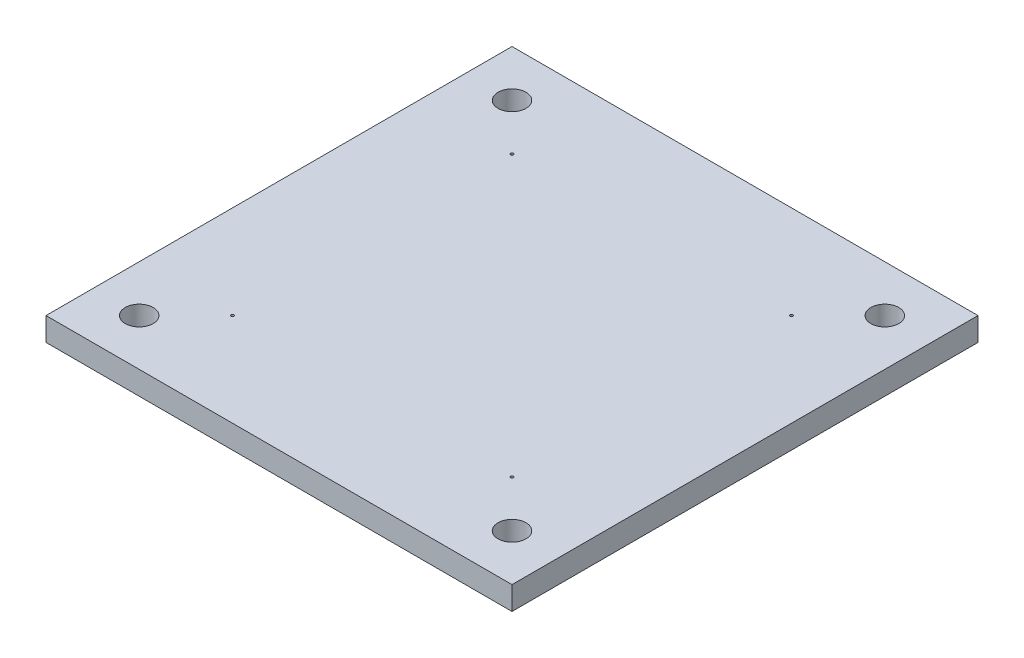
ISO-10303-21;
HEADER;
FILE_DESCRIPTION(('STEP AP214'),'2;1');
FILE_NAME('part.step','',(''),(''),'','','');
FILE_SCHEMA(('AUTOMOTIVE_DESIGN { 1 0 10303 214 1 1 1 1 }'));
ENDSEC;
DATA;
#1=APPLICATION_CONTEXT('core data for automotive mechanical design processes');
#2=APPLICATION_PROTOCOL_DEFINITION('international standard','automotive_design',2000,#1);
#3=PRODUCT_CONTEXT('',#1,'mechanical');
#4=PRODUCT('Part','Part','',(#3));
#5=PRODUCT_RELATED_PRODUCT_CATEGORY('part','',(#4));
#6=PRODUCT_DEFINITION_FORMATION('','',#4);
#7=PRODUCT_DEFINITION_CONTEXT('part definition',#1,'design');
#8=PRODUCT_DEFINITION('design','',#6,#7);
#9=PRODUCT_DEFINITION_SHAPE('','',#8);
#10=(LENGTH_UNIT() NAMED_UNIT(*) SI_UNIT(.MILLI.,.METRE.));
#11=(NAMED_UNIT(*) PLANE_ANGLE_UNIT() SI_UNIT($,.RADIAN.));
#12=(NAMED_UNIT(*) SI_UNIT($,.STERADIAN.) SOLID_ANGLE_UNIT());
#13=UNCERTAINTY_MEASURE_WITH_UNIT(LENGTH_MEASURE(1.E-05),#10,'distance_accuracy_value','');
#14=(GEOMETRIC_REPRESENTATION_CONTEXT(3) GLOBAL_UNCERTAINTY_ASSIGNED_CONTEXT((#13)) GLOBAL_UNIT_ASSIGNED_CONTEXT((#10,
#11,#12)) REPRESENTATION_CONTEXT('',''));
#15=CARTESIAN_POINT('',(0.,0.,0.));
#16=DIRECTION('',(0.,0.,1.));
#17=DIRECTION('',(1.,0.,0.));
#18=AXIS2_PLACEMENT_3D('',#15,#16,#17);
#19=CARTESIAN_POINT('',(-250.,25.,250.));
#20=DIRECTION('',(0.,-1.,0.));
#21=DIRECTION('',(0.,0.,-1.));
#22=AXIS2_PLACEMENT_3D('',#19,#20,#21);
#23=PLANE('',#22);
#24=CARTESIAN_POINT('',(200.,25.,-200.));
#25=DIRECTION('',(0.,-1.,0.));
#26=DIRECTION('',(0.,0.,1.));
#27=AXIS2_PLACEMENT_3D('',#24,#25,#26);
#28=CIRCLE('',#27,15.);
#29=CARTESIAN_POINT('',(200.,25.,-185.));
#30=VERTEX_POINT('',#29);
#31=EDGE_CURVE('E452',#30,#30,#28,.T.);
#32=ORIENTED_EDGE('',*,*,#31,.T.);
#33=EDGE_LOOP('',(#32));
#34=FACE_BOUND('',#33,.T.);
#35=CARTESIAN_POINT('',(150.,25.,150.));
#36=DIRECTION('',(0.,-1.,0.));
#37=DIRECTION('',(-0.70710678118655,0.,-0.707106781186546));
#38=AXIS2_PLACEMENT_3D('',#35,#36,#37);
#39=ELLIPSE('',#38,1.50763363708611,1.50000000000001);
#40=CARTESIAN_POINT('',(148.933942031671,25.,148.933942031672));
#41=VERTEX_POINT('',#40);
#42=EDGE_CURVE('E437',#41,#41,#39,.T.);
#43=ORIENTED_EDGE('',*,*,#42,.T.);
#44=EDGE_LOOP('',(#43));
#45=FACE_BOUND('',#44,.T.);
#46=CARTESIAN_POINT('',(200.,25.,200.));
#47=DIRECTION('',(0.,1.,0.));
#48=DIRECTION('',(0.,0.,-1.));
#49=AXIS2_PLACEMENT_3D('',#46,#47,#48);
#50=CIRCLE('',#49,15.);
#51=CARTESIAN_POINT('',(200.,25.,185.));
#52=VERTEX_POINT('',#51);
#53=EDGE_CURVE('E439',#52,#52,#50,.T.);
#54=ORIENTED_EDGE('',*,*,#53,.F.);
#55=EDGE_LOOP('',(#54));
#56=FACE_BOUND('',#55,.T.);
#57=CARTESIAN_POINT('',(-200.,25.,200.));
#58=DIRECTION('',(0.,-1.,0.));
#59=DIRECTION('',(0.,0.,-1.));
#60=AXIS2_PLACEMENT_3D('',#57,#58,#59);
#61=CIRCLE('',#60,15.);
#62=CARTESIAN_POINT('',(-200.,25.,185.));
#63=VERTEX_POINT('',#62);
#64=EDGE_CURVE('E435',#63,#63,#61,.T.);
#65=ORIENTED_EDGE('',*,*,#64,.T.);
#66=EDGE_LOOP('',(#65));
#67=FACE_BOUND('',#66,.T.);
#68=CARTESIAN_POINT('',(-150.,25.,-150.));
#69=DIRECTION('',(0.,-1.,0.));
#70=DIRECTION('',(0.70710678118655,0.,0.707106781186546));
#71=AXIS2_PLACEMENT_3D('',#68,#69,#70);
#72=ELLIPSE('',#71,1.50763363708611,1.50000000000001);
#73=CARTESIAN_POINT('',(-148.933942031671,25.,-148.933942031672));
#74=VERTEX_POINT('',#73);
#75=EDGE_CURVE('E429',#74,#74,#72,.T.);
#76=ORIENTED_EDGE('',*,*,#75,.T.);
#77=EDGE_LOOP('',(#76));
#78=FACE_BOUND('',#77,.T.);
#79=CARTESIAN_POINT('',(-200.,25.,-200.));
#80=DIRECTION('',(0.,1.,0.));
#81=DIRECTION('',(0.,0.,1.));
#82=AXIS2_PLACEMENT_3D('',#79,#80,#81);
#83=CIRCLE('',#82,15.);
#84=CARTESIAN_POINT('',(-200.,25.,-185.));
#85=VERTEX_POINT('',#84);
#86=EDGE_CURVE('E412',#85,#85,#83,.T.);
#87=ORIENTED_EDGE('',*,*,#86,.F.);
#88=EDGE_LOOP('',(#87));
#89=FACE_BOUND('',#88,.T.);
#90=DIRECTION('',(0.,0.,1.));
#91=VECTOR('',#90,1.);
#92=CARTESIAN_POINT('',(-250.,25.,250.));
#93=LINE('',#92,#91);
#94=CARTESIAN_POINT('',(-250.,25.,-250.));
#95=VERTEX_POINT('',#94);
#96=CARTESIAN_POINT('',(-250.,25.,250.));
#97=VERTEX_POINT('',#96);
#98=EDGE_CURVE('E419',#95,#97,#93,.T.);
#99=ORIENTED_EDGE('',*,*,#98,.T.);
#100=DIRECTION('',(1.,0.,0.));
#101=VECTOR('',#100,1.);
#102=CARTESIAN_POINT('',(-250.,25.,250.));
#103=LINE('',#102,#101);
#104=CARTESIAN_POINT('',(250.,25.,250.));
#105=VERTEX_POINT('',#104);
#106=EDGE_CURVE('E404',#97,#105,#103,.T.);
#107=ORIENTED_EDGE('',*,*,#106,.T.);
#108=DIRECTION('',(0.,0.,-1.));
#109=VECTOR('',#108,1.);
#110=CARTESIAN_POINT('',(250.,25.,250.));
#111=LINE('',#110,#109);
#112=CARTESIAN_POINT('',(250.,25.,-250.));
#113=VERTEX_POINT('',#112);
#114=EDGE_CURVE('E370',#105,#113,#111,.T.);
#115=ORIENTED_EDGE('',*,*,#114,.T.);
#116=DIRECTION('',(-1.,0.,0.));
#117=VECTOR('',#116,1.);
#118=CARTESIAN_POINT('',(-250.,25.,-250.));
#119=LINE('',#118,#117);
#120=EDGE_CURVE('E365',#113,#95,#119,.T.);
#121=ORIENTED_EDGE('',*,*,#120,.T.);
#122=EDGE_LOOP('',(#99,#107,#115,#121));
#123=FACE_BOUND('',#122,.T.);
#124=CARTESIAN_POINT('',(-150.,25.,150.));
#125=DIRECTION('',(0.,-1.,0.));
#126=DIRECTION('',(0.70710678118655,0.,-0.707106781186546));
#127=AXIS2_PLACEMENT_3D('',#124,#125,#126);
#128=ELLIPSE('',#127,1.50763363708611,1.50000000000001);
#129=CARTESIAN_POINT('',(-148.933942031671,25.,148.933942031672));
#130=VERTEX_POINT('',#129);
#131=EDGE_CURVE('E433',#130,#130,#128,.F.);
#132=ORIENTED_EDGE('',*,*,#131,.F.);
#133=EDGE_LOOP('',(#132));
#134=FACE_BOUND('',#133,.T.);
#135=CARTESIAN_POINT('',(150.,25.,-150.));
#136=DIRECTION('',(0.,-1.,0.));
#137=DIRECTION('',(-0.70710678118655,0.,0.707106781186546));
#138=AXIS2_PLACEMENT_3D('',#135,#136,#137);
#139=ELLIPSE('',#138,1.50763363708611,1.50000000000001);
#140=CARTESIAN_POINT('',(148.933942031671,25.,-148.933942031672));
#141=VERTEX_POINT('',#140);
#142=EDGE_CURVE('E352',#141,#141,#139,.F.);
#143=ORIENTED_EDGE('',*,*,#142,.F.);
#144=EDGE_LOOP('',(#143));
#145=FACE_BOUND('',#144,.T.);
#146=ADVANCED_FACE('F348',(#34,#45,#56,#67,#78,#89,#123,#134,#145),#23,.F.);
#147=CARTESIAN_POINT('',(-250.,0.,250.));
#148=DIRECTION('',(0.,-1.,0.));
#149=DIRECTION('',(0.,0.,-1.));
#150=AXIS2_PLACEMENT_3D('',#147,#148,#149);
#151=PLANE('',#150);
#152=CARTESIAN_POINT('',(-200.,0.,200.));
#153=DIRECTION('',(0.,-1.,0.));
#154=DIRECTION('',(0.,0.,-1.));
#155=AXIS2_PLACEMENT_3D('',#152,#153,#154);
#156=CIRCLE('',#155,15.);
#157=CARTESIAN_POINT('',(-200.,0.,185.));
#158=VERTEX_POINT('',#157);
#159=EDGE_CURVE('E462',#158,#158,#156,.T.);
#160=ORIENTED_EDGE('',*,*,#159,.F.);
#161=EDGE_LOOP('',(#160));
#162=FACE_BOUND('',#161,.T.);
#163=CARTESIAN_POINT('',(-200.,0.,-200.));
#164=DIRECTION('',(0.,1.,0.));
#165=DIRECTION('',(0.,0.,1.));
#166=AXIS2_PLACEMENT_3D('',#163,#164,#165);
#167=CIRCLE('',#166,15.);
#168=CARTESIAN_POINT('',(-200.,0.,-185.));
#169=VERTEX_POINT('',#168);
#170=EDGE_CURVE('E409',#169,#169,#167,.T.);
#171=ORIENTED_EDGE('',*,*,#170,.T.);
#172=EDGE_LOOP('',(#171));
#173=FACE_BOUND('',#172,.T.);
#174=DIRECTION('',(0.,0.,1.));
#175=VECTOR('',#174,1.);
#176=CARTESIAN_POINT('',(-250.,0.,250.));
#177=LINE('',#176,#175);
#178=CARTESIAN_POINT('',(-250.,0.,-250.));
#179=VERTEX_POINT('',#178);
#180=CARTESIAN_POINT('',(-250.,0.,250.));
#181=VERTEX_POINT('',#180);
#182=EDGE_CURVE('E396',#179,#181,#177,.T.);
#183=ORIENTED_EDGE('',*,*,#182,.F.);
#184=DIRECTION('',(-1.,0.,0.));
#185=VECTOR('',#184,1.);
#186=CARTESIAN_POINT('',(-250.,0.,-250.));
#187=LINE('',#186,#185);
#188=CARTESIAN_POINT('',(250.,0.,-250.));
#189=VERTEX_POINT('',#188);
#190=EDGE_CURVE('E417',#189,#179,#187,.T.);
#191=ORIENTED_EDGE('',*,*,#190,.F.);
#192=DIRECTION('',(0.,0.,-1.));
#193=VECTOR('',#192,1.);
#194=CARTESIAN_POINT('',(250.,0.,250.));
#195=LINE('',#194,#193);
#196=CARTESIAN_POINT('',(250.,0.,250.));
#197=VERTEX_POINT('',#196);
#198=EDGE_CURVE('E397',#197,#189,#195,.T.);
#199=ORIENTED_EDGE('',*,*,#198,.F.);
#200=DIRECTION('',(1.,0.,0.));
#201=VECTOR('',#200,1.);
#202=CARTESIAN_POINT('',(-250.,0.,250.));
#203=LINE('',#202,#201);
#204=EDGE_CURVE('E391',#181,#197,#203,.T.);
#205=ORIENTED_EDGE('',*,*,#204,.F.);
#206=EDGE_LOOP('',(#183,#191,#199,#205));
#207=FACE_BOUND('',#206,.T.);
#208=CARTESIAN_POINT('',(200.,0.,200.));
#209=DIRECTION('',(0.,1.,0.));
#210=DIRECTION('',(0.,0.,-1.));
#211=AXIS2_PLACEMENT_3D('',#208,#209,#210);
#212=CIRCLE('',#211,15.);
#213=CARTESIAN_POINT('',(200.,0.,185.));
#214=VERTEX_POINT('',#213);
#215=EDGE_CURVE('E444',#214,#214,#212,.T.);
#216=ORIENTED_EDGE('',*,*,#215,.T.);
#217=EDGE_LOOP('',(#216));
#218=FACE_BOUND('',#217,.T.);
#219=CARTESIAN_POINT('',(200.,0.,-200.));
#220=DIRECTION('',(0.,-1.,0.));
#221=DIRECTION('',(0.,0.,1.));
#222=AXIS2_PLACEMENT_3D('',#219,#220,#221);
#223=CIRCLE('',#222,15.);
#224=CARTESIAN_POINT('',(200.,0.,-185.));
#225=VERTEX_POINT('',#224);
#226=EDGE_CURVE('E447',#225,#225,#223,.T.);
#227=ORIENTED_EDGE('',*,*,#226,.F.);
#228=EDGE_LOOP('',(#227));
#229=FACE_BOUND('',#228,.T.);
#230=ADVANCED_FACE('F392',(#162,#173,#207,#218,#229),#151,.T.);
#231=CARTESIAN_POINT('',(-250.,25.,250.));
#232=DIRECTION('',(1.,0.,0.));
#233=DIRECTION('',(0.,0.,-1.));
#234=AXIS2_PLACEMENT_3D('',#231,#232,#233);
#235=PLANE('',#234);
#236=ORIENTED_EDGE('',*,*,#182,.T.);
#237=DIRECTION('',(0.,-1.,0.));
#238=VECTOR('',#237,1.);
#239=CARTESIAN_POINT('',(-250.,25.,250.));
#240=LINE('',#239,#238);
#241=EDGE_CURVE('E11',#97,#181,#240,.T.);
#242=ORIENTED_EDGE('',*,*,#241,.F.);
#243=ORIENTED_EDGE('',*,*,#98,.F.);
#244=DIRECTION('',(0.,-1.,0.));
#245=VECTOR('',#244,1.);
#246=CARTESIAN_POINT('',(-250.,25.,-250.));
#247=LINE('',#246,#245);
#248=EDGE_CURVE('E408',#95,#179,#247,.T.);
#249=ORIENTED_EDGE('',*,*,#248,.T.);
#250=EDGE_LOOP('',(#236,#242,#243,#249));
#251=FACE_BOUND('',#250,.T.);
#252=ADVANCED_FACE('F350',(#251),#235,.F.);
#253=CARTESIAN_POINT('',(-250.,25.,250.));
#254=DIRECTION('',(0.,0.,-1.));
#255=DIRECTION('',(-1.,0.,0.));
#256=AXIS2_PLACEMENT_3D('',#253,#254,#255);
#257=PLANE('',#256);
#258=ORIENTED_EDGE('',*,*,#204,.T.);
#259=DIRECTION('',(0.,-1.,0.));
#260=VECTOR('',#259,1.);
#261=CARTESIAN_POINT('',(250.,25.,250.));
#262=LINE('',#261,#260);
#263=EDGE_CURVE('E357',#105,#197,#262,.T.);
#264=ORIENTED_EDGE('',*,*,#263,.F.);
#265=ORIENTED_EDGE('',*,*,#106,.F.);
#266=ORIENTED_EDGE('',*,*,#241,.T.);
#267=EDGE_LOOP('',(#258,#264,#265,#266));
#268=FACE_BOUND('',#267,.T.);
#269=ADVANCED_FACE('F403',(#268),#257,.F.);
#270=CARTESIAN_POINT('',(250.,25.,250.));
#271=DIRECTION('',(-1.,0.,0.));
#272=DIRECTION('',(0.,0.,1.));
#273=AXIS2_PLACEMENT_3D('',#270,#271,#272);
#274=PLANE('',#273);
#275=ORIENTED_EDGE('',*,*,#198,.T.);
#276=DIRECTION('',(0.,-1.,0.));
#277=VECTOR('',#276,1.);
#278=CARTESIAN_POINT('',(250.,25.,-250.));
#279=LINE('',#278,#277);
#280=EDGE_CURVE('E425',#113,#189,#279,.T.);
#281=ORIENTED_EDGE('',*,*,#280,.F.);
#282=ORIENTED_EDGE('',*,*,#114,.F.);
#283=ORIENTED_EDGE('',*,*,#263,.T.);
#284=EDGE_LOOP('',(#275,#281,#282,#283));
#285=FACE_BOUND('',#284,.T.);
#286=ADVANCED_FACE('F540',(#285),#274,.F.);
#287=CARTESIAN_POINT('',(-250.,25.,-250.));
#288=DIRECTION('',(0.,0.,1.));
#289=DIRECTION('',(1.,0.,0.));
#290=AXIS2_PLACEMENT_3D('',#287,#288,#289);
#291=PLANE('',#290);
#292=ORIENTED_EDGE('',*,*,#190,.T.);
#293=ORIENTED_EDGE('',*,*,#248,.F.);
#294=ORIENTED_EDGE('',*,*,#120,.F.);
#295=ORIENTED_EDGE('',*,*,#280,.T.);
#296=EDGE_LOOP('',(#292,#293,#294,#295));
#297=FACE_BOUND('',#296,.T.);
#298=ADVANCED_FACE('F533',(#297),#291,.F.);
#299=CARTESIAN_POINT('',(-200.,0.,-200.));
#300=DIRECTION('',(0.,1.,0.));
#301=DIRECTION('',(0.,0.,1.));
#302=AXIS2_PLACEMENT_3D('',#299,#300,#301);
#303=CYLINDRICAL_SURFACE('',#302,15.);
#304=ORIENTED_EDGE('',*,*,#170,.F.);
#305=EDGE_LOOP('',(#304));
#306=FACE_BOUND('',#305,.T.);
#307=ORIENTED_EDGE('',*,*,#86,.T.);
#308=EDGE_LOOP('',(#307));
#309=FACE_BOUND('',#308,.T.);
#310=ADVANCED_FACE('F469',(#306,#309),#303,.F.);
#311=CARTESIAN_POINT('',(-150.355334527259,20.0253166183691,-150.35533452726));
#312=DIRECTION('',(0.0710669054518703,0.994936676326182,0.0710669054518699));
#313=DIRECTION('',(-0.997458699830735,0.0712470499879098,0.));
#314=AXIS2_PLACEMENT_3D('',#311,#312,#313);
#315=CYLINDRICAL_SURFACE('',#314,1.50000000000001);
#316=CARTESIAN_POINT('',(-150.355334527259,20.0253166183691,-150.35533452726));
#317=DIRECTION('',(0.0710669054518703,0.994936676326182,0.0710669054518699));
#318=DIRECTION('',(-0.997458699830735,0.0712470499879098,0.));
#319=AXIS2_PLACEMENT_3D('',#316,#317,#318);
#320=CIRCLE('',#319,1.50000000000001);
#321=CARTESIAN_POINT('',(-151.851522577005,20.132187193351,-150.35533452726));
#322=VERTEX_POINT('',#321);
#323=EDGE_CURVE('E432',#322,#322,#320,.T.);
#324=ORIENTED_EDGE('',*,*,#323,.F.);
#325=EDGE_LOOP('',(#324));
#326=FACE_BOUND('',#325,.T.);
#327=ORIENTED_EDGE('',*,*,#75,.F.);
#328=EDGE_LOOP('',(#327));
#329=FACE_BOUND('',#328,.T.);
#330=ADVANCED_FACE('F526',(#326,#329),#315,.F.);
#331=CARTESIAN_POINT('',(-150.355334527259,20.0253166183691,-150.35533452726));
#332=DIRECTION('',(0.0710669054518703,0.994936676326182,0.0710669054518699));
#333=DIRECTION('',(-0.997458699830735,0.0712470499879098,0.));
#334=AXIS2_PLACEMENT_3D('',#331,#332,#333);
#335=PLANE('',#334);
#336=ORIENTED_EDGE('',*,*,#323,.T.);
#337=EDGE_LOOP('',(#336));
#338=FACE_BOUND('',#337,.T.);
#339=ADVANCED_FACE('F522',(#338),#335,.T.);
#340=CARTESIAN_POINT('',(-200.,0.,200.));
#341=DIRECTION('',(0.,1.,0.));
#342=DIRECTION('',(0.,0.,1.));
#343=AXIS2_PLACEMENT_3D('',#340,#341,#342);
#344=CYLINDRICAL_SURFACE('',#343,15.);
#345=ORIENTED_EDGE('',*,*,#159,.T.);
#346=EDGE_LOOP('',(#345));
#347=FACE_BOUND('',#346,.T.);
#348=ORIENTED_EDGE('',*,*,#64,.F.);
#349=EDGE_LOOP('',(#348));
#350=FACE_BOUND('',#349,.T.);
#351=ADVANCED_FACE('F518',(#347,#350),#344,.F.);
#352=CARTESIAN_POINT('',(-150.355334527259,20.0253166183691,150.35533452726));
#353=DIRECTION('',(0.0710669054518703,0.994936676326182,-0.0710669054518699));
#354=DIRECTION('',(-0.997458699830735,0.0712470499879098,0.));
#355=AXIS2_PLACEMENT_3D('',#352,#353,#354);
#356=CYLINDRICAL_SURFACE('',#355,1.50000000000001);
#357=CARTESIAN_POINT('',(-150.355334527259,20.0253166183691,150.35533452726));
#358=DIRECTION('',(-0.0710669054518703,-0.994936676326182,0.0710669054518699));
#359=DIRECTION('',(-0.997458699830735,0.0712470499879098,0.));
#360=AXIS2_PLACEMENT_3D('',#357,#358,#359);
#361=CIRCLE('',#360,1.50000000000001);
#362=CARTESIAN_POINT('',(-151.851522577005,20.132187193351,150.35533452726));
#363=VERTEX_POINT('',#362);
#364=EDGE_CURVE('E436',#363,#363,#361,.T.);
#365=ORIENTED_EDGE('',*,*,#364,.T.);
#366=EDGE_LOOP('',(#365));
#367=FACE_BOUND('',#366,.T.);
#368=ORIENTED_EDGE('',*,*,#131,.T.);
#369=EDGE_LOOP('',(#368));
#370=FACE_BOUND('',#369,.T.);
#371=ADVANCED_FACE('F514',(#367,#370),#356,.F.);
#372=CARTESIAN_POINT('',(-150.355334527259,20.0253166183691,150.35533452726));
#373=DIRECTION('',(0.0710669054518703,0.994936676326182,-0.0710669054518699));
#374=DIRECTION('',(-0.997458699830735,0.0712470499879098,0.));
#375=AXIS2_PLACEMENT_3D('',#372,#373,#374);
#376=PLANE('',#375);
#377=ORIENTED_EDGE('',*,*,#364,.F.);
#378=EDGE_LOOP('',(#377));
#379=FACE_BOUND('',#378,.T.);
#380=ADVANCED_FACE('F510',(#379),#376,.T.);
#381=CARTESIAN_POINT('',(200.,0.,200.));
#382=DIRECTION('',(0.,1.,0.));
#383=DIRECTION('',(0.,0.,1.));
#384=AXIS2_PLACEMENT_3D('',#381,#382,#383);
#385=CYLINDRICAL_SURFACE('',#384,15.);
#386=ORIENTED_EDGE('',*,*,#215,.F.);
#387=EDGE_LOOP('',(#386));
#388=FACE_BOUND('',#387,.T.);
#389=ORIENTED_EDGE('',*,*,#53,.T.);
#390=EDGE_LOOP('',(#389));
#391=FACE_BOUND('',#390,.T.);
#392=ADVANCED_FACE('F506',(#388,#391),#385,.F.);
#393=CARTESIAN_POINT('',(150.355334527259,20.0253166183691,150.35533452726));
#394=DIRECTION('',(-0.0710669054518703,0.994936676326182,-0.0710669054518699));
#395=DIRECTION('',(-0.997458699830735,-0.0712470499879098,0.));
#396=AXIS2_PLACEMENT_3D('',#393,#394,#395);
#397=CYLINDRICAL_SURFACE('',#396,1.50000000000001);
#398=CARTESIAN_POINT('',(150.355334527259,20.0253166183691,150.35533452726));
#399=DIRECTION('',(-0.0710669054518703,0.994936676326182,-0.0710669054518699));
#400=DIRECTION('',(0.997458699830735,0.0712470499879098,0.));
#401=AXIS2_PLACEMENT_3D('',#398,#399,#400);
#402=CIRCLE('',#401,1.50000000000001);
#403=CARTESIAN_POINT('',(151.851522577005,20.132187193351,150.35533452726));
#404=VERTEX_POINT('',#403);
#405=EDGE_CURVE('E440',#404,#404,#402,.T.);
#406=ORIENTED_EDGE('',*,*,#405,.F.);
#407=EDGE_LOOP('',(#406));
#408=FACE_BOUND('',#407,.T.);
#409=ORIENTED_EDGE('',*,*,#42,.F.);
#410=EDGE_LOOP('',(#409));
#411=FACE_BOUND('',#410,.T.);
#412=ADVANCED_FACE('F503',(#408,#411),#397,.F.);
#413=CARTESIAN_POINT('',(150.355334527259,20.0253166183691,150.35533452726));
#414=DIRECTION('',(-0.0710669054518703,0.994936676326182,-0.0710669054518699));
#415=DIRECTION('',(0.997458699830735,0.0712470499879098,0.));
#416=AXIS2_PLACEMENT_3D('',#413,#414,#415);
#417=PLANE('',#416);
#418=ORIENTED_EDGE('',*,*,#405,.T.);
#419=EDGE_LOOP('',(#418));
#420=FACE_BOUND('',#419,.T.);
#421=ADVANCED_FACE('F499',(#420),#417,.T.);
#422=CARTESIAN_POINT('',(200.,0.,-200.));
#423=DIRECTION('',(0.,1.,0.));
#424=DIRECTION('',(0.,0.,1.));
#425=AXIS2_PLACEMENT_3D('',#422,#423,#424);
#426=CYLINDRICAL_SURFACE('',#425,15.);
#427=ORIENTED_EDGE('',*,*,#226,.T.);
#428=EDGE_LOOP('',(#427));
#429=FACE_BOUND('',#428,.T.);
#430=ORIENTED_EDGE('',*,*,#31,.F.);
#431=EDGE_LOOP('',(#430));
#432=FACE_BOUND('',#431,.T.);
#433=ADVANCED_FACE('F494',(#429,#432),#426,.F.);
#434=CARTESIAN_POINT('',(150.355334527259,20.0253166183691,-150.35533452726));
#435=DIRECTION('',(-0.0710669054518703,0.994936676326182,0.0710669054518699));
#436=DIRECTION('',(-0.997458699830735,-0.0712470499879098,0.));
#437=AXIS2_PLACEMENT_3D('',#434,#435,#436);
#438=CYLINDRICAL_SURFACE('',#437,1.50000000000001);
#439=CARTESIAN_POINT('',(150.355334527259,20.0253166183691,-150.35533452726));
#440=DIRECTION('',(0.0710669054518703,-0.994936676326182,-0.0710669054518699));
#441=DIRECTION('',(0.997458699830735,0.0712470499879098,0.));
#442=AXIS2_PLACEMENT_3D('',#439,#440,#441);
#443=CIRCLE('',#442,1.50000000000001);
#444=CARTESIAN_POINT('',(151.851522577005,20.132187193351,-150.35533452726));
#445=VERTEX_POINT('',#444);
#446=EDGE_CURVE('E480',#445,#445,#443,.T.);
#447=ORIENTED_EDGE('',*,*,#446,.T.);
#448=EDGE_LOOP('',(#447));
#449=FACE_BOUND('',#448,.T.);
#450=ORIENTED_EDGE('',*,*,#142,.T.);
#451=EDGE_LOOP('',(#450));
#452=FACE_BOUND('',#451,.T.);
#453=ADVANCED_FACE('F486',(#449,#452),#438,.F.);
#454=CARTESIAN_POINT('',(150.355334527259,20.0253166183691,-150.35533452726));
#455=DIRECTION('',(-0.0710669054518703,0.994936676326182,0.0710669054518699));
#456=DIRECTION('',(0.997458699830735,0.0712470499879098,0.));
#457=AXIS2_PLACEMENT_3D('',#454,#455,#456);
#458=PLANE('',#457);
#459=ORIENTED_EDGE('',*,*,#446,.F.);
#460=EDGE_LOOP('',(#459));
#461=FACE_BOUND('',#460,.T.);
#462=ADVANCED_FACE('F488',(#461),#458,.T.);
#463=CLOSED_SHELL('',(#146,#230,#252,#269,#286,#298,#310,#330,#339,#351,#371,#380,#392,#412,
#421,#433,#453,#462));
#464=MANIFOLD_SOLID_BREP('B2',#463);
#465=ADVANCED_BREP_SHAPE_REPRESENTATION('',(#18,#464),#14);
#466=SHAPE_DEFINITION_REPRESENTATION(#9,#465);
ENDSEC;
END-ISO-10303-21;
